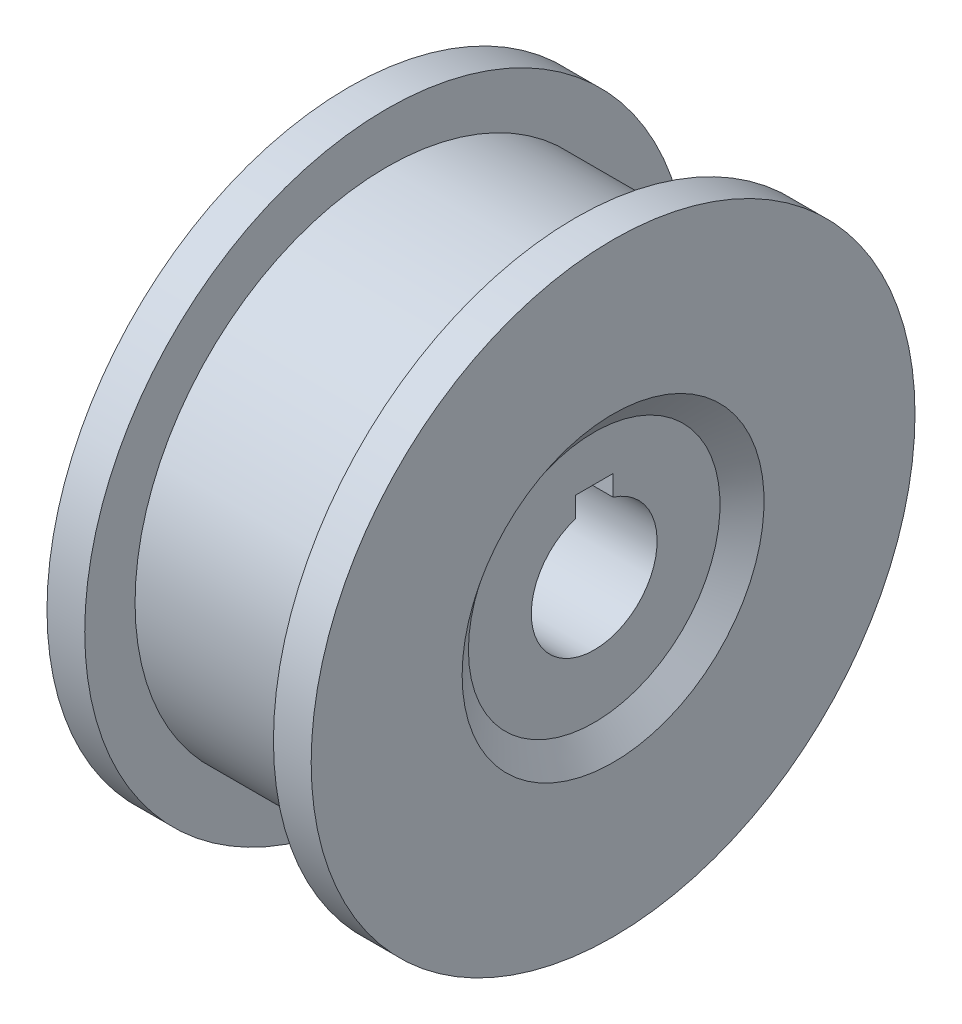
ISO-10303-21;
HEADER;
FILE_DESCRIPTION(('STEP AP214'),'2;1');
FILE_NAME('part.step','',(''),(''),'','','');
FILE_SCHEMA(('AUTOMOTIVE_DESIGN { 1 0 10303 214 1 1 1 1 }'));
ENDSEC;
DATA;
#1=APPLICATION_CONTEXT('core data for automotive mechanical design processes');
#2=APPLICATION_PROTOCOL_DEFINITION('international standard','automotive_design',2000,#1);
#3=PRODUCT_CONTEXT('',#1,'mechanical');
#4=PRODUCT('Part','Part','',(#3));
#5=PRODUCT_RELATED_PRODUCT_CATEGORY('part','',(#4));
#6=PRODUCT_DEFINITION_FORMATION('','',#4);
#7=PRODUCT_DEFINITION_CONTEXT('part definition',#1,'design');
#8=PRODUCT_DEFINITION('design','',#6,#7);
#9=PRODUCT_DEFINITION_SHAPE('','',#8);
#10=(LENGTH_UNIT() NAMED_UNIT(*) SI_UNIT(.MILLI.,.METRE.));
#11=(NAMED_UNIT(*) PLANE_ANGLE_UNIT() SI_UNIT($,.RADIAN.));
#12=(NAMED_UNIT(*) SI_UNIT($,.STERADIAN.) SOLID_ANGLE_UNIT());
#13=UNCERTAINTY_MEASURE_WITH_UNIT(LENGTH_MEASURE(1.E-05),#10,'distance_accuracy_value','');
#14=(GEOMETRIC_REPRESENTATION_CONTEXT(3) GLOBAL_UNCERTAINTY_ASSIGNED_CONTEXT((#13)) GLOBAL_UNIT_ASSIGNED_CONTEXT((#10,
#11,#12)) REPRESENTATION_CONTEXT('',''));
#15=CARTESIAN_POINT('',(0.,0.,0.));
#16=DIRECTION('',(0.,0.,1.));
#17=DIRECTION('',(1.,0.,0.));
#18=AXIS2_PLACEMENT_3D('',#15,#16,#17);
#19=CARTESIAN_POINT('',(0.,0.,0.));
#20=DIRECTION('',(-1.,0.,0.));
#21=DIRECTION('',(0.,0.,1.));
#22=AXIS2_PLACEMENT_3D('',#19,#20,#21);
#23=CYLINDRICAL_SURFACE('',#22,5.);
#24=CARTESIAN_POINT('',(-9.,0.,0.));
#25=DIRECTION('',(-1.,0.,0.));
#26=DIRECTION('',(0.,0.,1.));
#27=AXIS2_PLACEMENT_3D('',#24,#25,#26);
#28=CIRCLE('',#27,5.);
#29=CARTESIAN_POINT('',(-9.,4.76969600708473,-1.5));
#30=VERTEX_POINT('',#29);
#31=CARTESIAN_POINT('',(-9.,4.76969600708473,1.5));
#32=VERTEX_POINT('',#31);
#33=EDGE_CURVE('E97',#30,#32,#28,.T.);
#34=ORIENTED_EDGE('',*,*,#33,.T.);
#35=DIRECTION('',(-1.,0.,0.));
#36=VECTOR('',#35,1.);
#37=CARTESIAN_POINT('',(0.,4.76969600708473,1.5));
#38=LINE('',#37,#36);
#39=CARTESIAN_POINT('',(9.,4.76969600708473,1.5));
#40=VERTEX_POINT('',#39);
#41=EDGE_CURVE('E55',#32,#40,#38,.F.);
#42=ORIENTED_EDGE('',*,*,#41,.T.);
#43=CARTESIAN_POINT('',(9.,0.,0.));
#44=DIRECTION('',(-1.,0.,0.));
#45=DIRECTION('',(0.,0.,1.));
#46=AXIS2_PLACEMENT_3D('',#43,#44,#45);
#47=CIRCLE('',#46,5.);
#48=CARTESIAN_POINT('',(9.,4.76969600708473,-1.5));
#49=VERTEX_POINT('',#48);
#50=EDGE_CURVE('E130',#49,#40,#47,.T.);
#51=ORIENTED_EDGE('',*,*,#50,.F.);
#52=DIRECTION('',(-1.,0.,0.));
#53=VECTOR('',#52,1.);
#54=CARTESIAN_POINT('',(0.,4.76969600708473,-1.5));
#55=LINE('',#54,#53);
#56=EDGE_CURVE('E84',#49,#30,#55,.T.);
#57=ORIENTED_EDGE('',*,*,#56,.T.);
#58=EDGE_LOOP('',(#34,#42,#51,#57));
#59=FACE_BOUND('',#58,.T.);
#60=ADVANCED_FACE('F33',(#59),#23,.F.);
#61=CARTESIAN_POINT('',(9.,10.,0.));
#62=DIRECTION('',(-1.,0.,0.));
#63=DIRECTION('',(0.,0.,1.));
#64=AXIS2_PLACEMENT_3D('',#61,#62,#63);
#65=PLANE('',#64);
#66=CARTESIAN_POINT('',(9.,0.,0.));
#67=DIRECTION('',(-1.,0.,0.));
#68=DIRECTION('',(0.,0.,1.));
#69=AXIS2_PLACEMENT_3D('',#66,#67,#68);
#70=CIRCLE('',#69,10.);
#71=CARTESIAN_POINT('',(9.,0.,10.));
#72=VERTEX_POINT('',#71);
#73=EDGE_CURVE('E127',#72,#72,#70,.T.);
#74=ORIENTED_EDGE('',*,*,#73,.F.);
#75=EDGE_LOOP('',(#74));
#76=FACE_BOUND('',#75,.T.);
#77=ORIENTED_EDGE('',*,*,#50,.T.);
#78=DIRECTION('',(0.,-1.,0.));
#79=VECTOR('',#78,1.);
#80=CARTESIAN_POINT('',(9.,0.,1.5));
#81=LINE('',#80,#79);
#82=CARTESIAN_POINT('',(9.,6.4,1.5));
#83=VERTEX_POINT('',#82);
#84=EDGE_CURVE('E88',#83,#40,#81,.T.);
#85=ORIENTED_EDGE('',*,*,#84,.F.);
#86=DIRECTION('',(0.,0.,1.));
#87=VECTOR('',#86,1.);
#88=CARTESIAN_POINT('',(9.,6.4,1.5));
#89=LINE('',#88,#87);
#90=CARTESIAN_POINT('',(9.,6.4,-1.5));
#91=VERTEX_POINT('',#90);
#92=EDGE_CURVE('E74',#91,#83,#89,.T.);
#93=ORIENTED_EDGE('',*,*,#92,.F.);
#94=DIRECTION('',(0.,1.,0.));
#95=VECTOR('',#94,1.);
#96=CARTESIAN_POINT('',(9.,0.,-1.5));
#97=LINE('',#96,#95);
#98=EDGE_CURVE('E81',#49,#91,#97,.T.);
#99=ORIENTED_EDGE('',*,*,#98,.F.);
#100=EDGE_LOOP('',(#77,#85,#93,#99));
#101=FACE_BOUND('',#100,.T.);
#102=ADVANCED_FACE('F90',(#76,#101),#65,.F.);
#103=CARTESIAN_POINT('',(9.,0.,0.));
#104=DIRECTION('',(1.,0.,0.));
#105=DIRECTION('',(0.,0.,-1.));
#106=AXIS2_PLACEMENT_3D('',#103,#104,#105);
#107=CONICAL_SURFACE('',#106,10.,0.927295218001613);
#108=CARTESIAN_POINT('',(10.5,0.,0.));
#109=DIRECTION('',(-1.,0.,0.));
#110=DIRECTION('',(0.,0.,1.));
#111=AXIS2_PLACEMENT_3D('',#108,#109,#110);
#112=CIRCLE('',#111,12.);
#113=CARTESIAN_POINT('',(10.5,0.,12.));
#114=VERTEX_POINT('',#113);
#115=EDGE_CURVE('E124',#114,#114,#112,.T.);
#116=ORIENTED_EDGE('',*,*,#115,.F.);
#117=EDGE_LOOP('',(#116));
#118=FACE_BOUND('',#117,.T.);
#119=ORIENTED_EDGE('',*,*,#73,.T.);
#120=EDGE_LOOP('',(#119));
#121=FACE_BOUND('',#120,.T.);
#122=ADVANCED_FACE('F142',(#118,#121),#107,.F.);
#123=CARTESIAN_POINT('',(10.5,24.,0.));
#124=DIRECTION('',(-1.,0.,0.));
#125=DIRECTION('',(0.,0.,1.));
#126=AXIS2_PLACEMENT_3D('',#123,#124,#125);
#127=PLANE('',#126);
#128=CARTESIAN_POINT('',(10.5,0.,0.));
#129=DIRECTION('',(-1.,0.,0.));
#130=DIRECTION('',(0.,0.,1.));
#131=AXIS2_PLACEMENT_3D('',#128,#129,#130);
#132=CIRCLE('',#131,24.);
#133=CARTESIAN_POINT('',(10.5,0.,24.));
#134=VERTEX_POINT('',#133);
#135=EDGE_CURVE('E121',#134,#134,#132,.T.);
#136=ORIENTED_EDGE('',*,*,#135,.F.);
#137=EDGE_LOOP('',(#136));
#138=FACE_BOUND('',#137,.T.);
#139=ORIENTED_EDGE('',*,*,#115,.T.);
#140=EDGE_LOOP('',(#139));
#141=FACE_BOUND('',#140,.T.);
#142=ADVANCED_FACE('F147',(#138,#141),#127,.F.);
#143=CARTESIAN_POINT('',(0.,0.,0.));
#144=DIRECTION('',(-1.,0.,0.));
#145=DIRECTION('',(0.,0.,1.));
#146=AXIS2_PLACEMENT_3D('',#143,#144,#145);
#147=CYLINDRICAL_SURFACE('',#146,24.);
#148=CARTESIAN_POINT('',(7.5,0.,0.));
#149=DIRECTION('',(-1.,0.,0.));
#150=DIRECTION('',(0.,0.,1.));
#151=AXIS2_PLACEMENT_3D('',#148,#149,#150);
#152=CIRCLE('',#151,24.);
#153=CARTESIAN_POINT('',(7.5,0.,24.));
#154=VERTEX_POINT('',#153);
#155=EDGE_CURVE('E118',#154,#154,#152,.T.);
#156=ORIENTED_EDGE('',*,*,#155,.F.);
#157=EDGE_LOOP('',(#156));
#158=FACE_BOUND('',#157,.T.);
#159=ORIENTED_EDGE('',*,*,#135,.T.);
#160=EDGE_LOOP('',(#159));
#161=FACE_BOUND('',#160,.T.);
#162=ADVANCED_FACE('F154',(#158,#161),#147,.T.);
#163=CARTESIAN_POINT('',(7.5,20.,0.));
#164=DIRECTION('',(1.,0.,0.));
#165=DIRECTION('',(0.,0.,-1.));
#166=AXIS2_PLACEMENT_3D('',#163,#164,#165);
#167=PLANE('',#166);
#168=CARTESIAN_POINT('',(7.5,0.,0.));
#169=DIRECTION('',(-1.,0.,0.));
#170=DIRECTION('',(0.,0.,1.));
#171=AXIS2_PLACEMENT_3D('',#168,#169,#170);
#172=CIRCLE('',#171,20.);
#173=CARTESIAN_POINT('',(7.5,0.,20.));
#174=VERTEX_POINT('',#173);
#175=EDGE_CURVE('E115',#174,#174,#172,.T.);
#176=ORIENTED_EDGE('',*,*,#175,.F.);
#177=EDGE_LOOP('',(#176));
#178=FACE_BOUND('',#177,.T.);
#179=ORIENTED_EDGE('',*,*,#155,.T.);
#180=EDGE_LOOP('',(#179));
#181=FACE_BOUND('',#180,.T.);
#182=ADVANCED_FACE('F158',(#178,#181),#167,.F.);
#183=CARTESIAN_POINT('',(0.,0.,0.));
#184=DIRECTION('',(-1.,0.,0.));
#185=DIRECTION('',(0.,0.,1.));
#186=AXIS2_PLACEMENT_3D('',#183,#184,#185);
#187=CYLINDRICAL_SURFACE('',#186,20.);
#188=CARTESIAN_POINT('',(-7.5,0.,0.));
#189=DIRECTION('',(-1.,0.,0.));
#190=DIRECTION('',(0.,0.,1.));
#191=AXIS2_PLACEMENT_3D('',#188,#189,#190);
#192=CIRCLE('',#191,20.);
#193=CARTESIAN_POINT('',(-7.5,0.,20.));
#194=VERTEX_POINT('',#193);
#195=EDGE_CURVE('E112',#194,#194,#192,.T.);
#196=ORIENTED_EDGE('',*,*,#195,.F.);
#197=EDGE_LOOP('',(#196));
#198=FACE_BOUND('',#197,.T.);
#199=ORIENTED_EDGE('',*,*,#175,.T.);
#200=EDGE_LOOP('',(#199));
#201=FACE_BOUND('',#200,.T.);
#202=ADVANCED_FACE('F162',(#198,#201),#187,.T.);
#203=CARTESIAN_POINT('',(-7.5,20.,0.));
#204=DIRECTION('',(-1.,0.,0.));
#205=DIRECTION('',(0.,0.,1.));
#206=AXIS2_PLACEMENT_3D('',#203,#204,#205);
#207=PLANE('',#206);
#208=CARTESIAN_POINT('',(-7.5,0.,0.));
#209=DIRECTION('',(-1.,0.,0.));
#210=DIRECTION('',(0.,0.,1.));
#211=AXIS2_PLACEMENT_3D('',#208,#209,#210);
#212=CIRCLE('',#211,24.);
#213=CARTESIAN_POINT('',(-7.5,0.,24.));
#214=VERTEX_POINT('',#213);
#215=EDGE_CURVE('E109',#214,#214,#212,.T.);
#216=ORIENTED_EDGE('',*,*,#215,.F.);
#217=EDGE_LOOP('',(#216));
#218=FACE_BOUND('',#217,.T.);
#219=ORIENTED_EDGE('',*,*,#195,.T.);
#220=EDGE_LOOP('',(#219));
#221=FACE_BOUND('',#220,.T.);
#222=ADVANCED_FACE('F166',(#218,#221),#207,.F.);
#223=CARTESIAN_POINT('',(0.,0.,0.));
#224=DIRECTION('',(-1.,0.,0.));
#225=DIRECTION('',(0.,0.,1.));
#226=AXIS2_PLACEMENT_3D('',#223,#224,#225);
#227=CYLINDRICAL_SURFACE('',#226,24.);
#228=CARTESIAN_POINT('',(-10.5,0.,0.));
#229=DIRECTION('',(-1.,0.,0.));
#230=DIRECTION('',(0.,0.,1.));
#231=AXIS2_PLACEMENT_3D('',#228,#229,#230);
#232=CIRCLE('',#231,24.);
#233=CARTESIAN_POINT('',(-10.5,0.,24.));
#234=VERTEX_POINT('',#233);
#235=EDGE_CURVE('E106',#234,#234,#232,.T.);
#236=ORIENTED_EDGE('',*,*,#235,.F.);
#237=EDGE_LOOP('',(#236));
#238=FACE_BOUND('',#237,.T.);
#239=ORIENTED_EDGE('',*,*,#215,.T.);
#240=EDGE_LOOP('',(#239));
#241=FACE_BOUND('',#240,.T.);
#242=ADVANCED_FACE('F170',(#238,#241),#227,.T.);
#243=CARTESIAN_POINT('',(-10.5,24.,0.));
#244=DIRECTION('',(1.,0.,0.));
#245=DIRECTION('',(0.,0.,-1.));
#246=AXIS2_PLACEMENT_3D('',#243,#244,#245);
#247=PLANE('',#246);
#248=CARTESIAN_POINT('',(-10.5,0.,0.));
#249=DIRECTION('',(-1.,0.,0.));
#250=DIRECTION('',(0.,0.,1.));
#251=AXIS2_PLACEMENT_3D('',#248,#249,#250);
#252=CIRCLE('',#251,12.);
#253=CARTESIAN_POINT('',(-10.5,0.,12.));
#254=VERTEX_POINT('',#253);
#255=EDGE_CURVE('E103',#254,#254,#252,.T.);
#256=ORIENTED_EDGE('',*,*,#255,.F.);
#257=EDGE_LOOP('',(#256));
#258=FACE_BOUND('',#257,.T.);
#259=ORIENTED_EDGE('',*,*,#235,.T.);
#260=EDGE_LOOP('',(#259));
#261=FACE_BOUND('',#260,.T.);
#262=ADVANCED_FACE('F174',(#258,#261),#247,.F.);
#263=CARTESIAN_POINT('',(-10.5,0.,0.));
#264=DIRECTION('',(-1.,0.,0.));
#265=DIRECTION('',(0.,0.,1.));
#266=AXIS2_PLACEMENT_3D('',#263,#264,#265);
#267=CONICAL_SURFACE('',#266,12.,0.927295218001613);
#268=CARTESIAN_POINT('',(-9.,0.,0.));
#269=DIRECTION('',(-1.,0.,0.));
#270=DIRECTION('',(0.,0.,1.));
#271=AXIS2_PLACEMENT_3D('',#268,#269,#270);
#272=CIRCLE('',#271,10.);
#273=CARTESIAN_POINT('',(-9.,0.,10.));
#274=VERTEX_POINT('',#273);
#275=EDGE_CURVE('E100',#274,#274,#272,.T.);
#276=ORIENTED_EDGE('',*,*,#275,.F.);
#277=EDGE_LOOP('',(#276));
#278=FACE_BOUND('',#277,.T.);
#279=ORIENTED_EDGE('',*,*,#255,.T.);
#280=EDGE_LOOP('',(#279));
#281=FACE_BOUND('',#280,.T.);
#282=ADVANCED_FACE('F178',(#278,#281),#267,.F.);
#283=CARTESIAN_POINT('',(-9.,10.,0.));
#284=DIRECTION('',(1.,0.,0.));
#285=DIRECTION('',(0.,0.,-1.));
#286=AXIS2_PLACEMENT_3D('',#283,#284,#285);
#287=PLANE('',#286);
#288=DIRECTION('',(0.,0.,1.));
#289=VECTOR('',#288,1.);
#290=CARTESIAN_POINT('',(-9.,6.4,0.));
#291=LINE('',#290,#289);
#292=CARTESIAN_POINT('',(-9.,6.4,-1.5));
#293=VERTEX_POINT('',#292);
#294=CARTESIAN_POINT('',(-9.,6.4,1.5));
#295=VERTEX_POINT('',#294);
#296=EDGE_CURVE('E40',#293,#295,#291,.T.);
#297=ORIENTED_EDGE('',*,*,#296,.T.);
#298=DIRECTION('',(0.,-1.,0.));
#299=VECTOR('',#298,1.);
#300=CARTESIAN_POINT('',(-9.,10.,1.5));
#301=LINE('',#300,#299);
#302=EDGE_CURVE('E11',#295,#32,#301,.T.);
#303=ORIENTED_EDGE('',*,*,#302,.T.);
#304=ORIENTED_EDGE('',*,*,#33,.F.);
#305=DIRECTION('',(0.,1.,0.));
#306=VECTOR('',#305,1.);
#307=CARTESIAN_POINT('',(-9.,10.,-1.5));
#308=LINE('',#307,#306);
#309=EDGE_CURVE('E132',#30,#293,#308,.T.);
#310=ORIENTED_EDGE('',*,*,#309,.T.);
#311=EDGE_LOOP('',(#297,#303,#304,#310));
#312=FACE_BOUND('',#311,.T.);
#313=ORIENTED_EDGE('',*,*,#275,.T.);
#314=EDGE_LOOP('',(#313));
#315=FACE_BOUND('',#314,.T.);
#316=ADVANCED_FACE('F134',(#312,#315),#287,.F.);
#317=CARTESIAN_POINT('',(-10.5,0.,1.5));
#318=DIRECTION('',(0.,0.,1.));
#319=DIRECTION('',(1.,0.,0.));
#320=AXIS2_PLACEMENT_3D('',#317,#318,#319);
#321=PLANE('',#320);
#322=ORIENTED_EDGE('',*,*,#302,.F.);
#323=DIRECTION('',(1.,0.,0.));
#324=VECTOR('',#323,1.);
#325=CARTESIAN_POINT('',(-10.5,6.4,1.5));
#326=LINE('',#325,#324);
#327=EDGE_CURVE('E78',#295,#83,#326,.T.);
#328=ORIENTED_EDGE('',*,*,#327,.T.);
#329=ORIENTED_EDGE('',*,*,#84,.T.);
#330=ORIENTED_EDGE('',*,*,#41,.F.);
#331=EDGE_LOOP('',(#322,#328,#329,#330));
#332=FACE_BOUND('',#331,.T.);
#333=ADVANCED_FACE('F185',(#332),#321,.F.);
#334=CARTESIAN_POINT('',(-10.5,6.4,1.5));
#335=DIRECTION('',(0.,1.,0.));
#336=DIRECTION('',(0.,0.,1.));
#337=AXIS2_PLACEMENT_3D('',#334,#335,#336);
#338=PLANE('',#337);
#339=DIRECTION('',(1.,0.,0.));
#340=VECTOR('',#339,1.);
#341=CARTESIAN_POINT('',(-10.5,6.4,-1.5));
#342=LINE('',#341,#340);
#343=EDGE_CURVE('E47',#293,#91,#342,.T.);
#344=ORIENTED_EDGE('',*,*,#343,.T.);
#345=ORIENTED_EDGE('',*,*,#92,.T.);
#346=ORIENTED_EDGE('',*,*,#327,.F.);
#347=ORIENTED_EDGE('',*,*,#296,.F.);
#348=EDGE_LOOP('',(#344,#345,#346,#347));
#349=FACE_BOUND('',#348,.T.);
#350=ADVANCED_FACE('F71',(#349),#338,.F.);
#351=CARTESIAN_POINT('',(-10.5,0.,-1.5));
#352=DIRECTION('',(0.,0.,-1.));
#353=DIRECTION('',(-1.,0.,0.));
#354=AXIS2_PLACEMENT_3D('',#351,#352,#353);
#355=PLANE('',#354);
#356=ORIENTED_EDGE('',*,*,#98,.T.);
#357=ORIENTED_EDGE('',*,*,#343,.F.);
#358=ORIENTED_EDGE('',*,*,#309,.F.);
#359=ORIENTED_EDGE('',*,*,#56,.F.);
#360=EDGE_LOOP('',(#356,#357,#358,#359));
#361=FACE_BOUND('',#360,.T.);
#362=ADVANCED_FACE('F82',(#361),#355,.F.);
#363=CLOSED_SHELL('',(#60,#102,#122,#142,#162,#182,#202,#222,#242,#262,#282,#316,#333,#350,#362));
#364=MANIFOLD_SOLID_BREP('B2',#363);
#365=ADVANCED_BREP_SHAPE_REPRESENTATION('',(#18,#364),#14);
#366=SHAPE_DEFINITION_REPRESENTATION(#9,#365);
ENDSEC;
END-ISO-10303-21;
